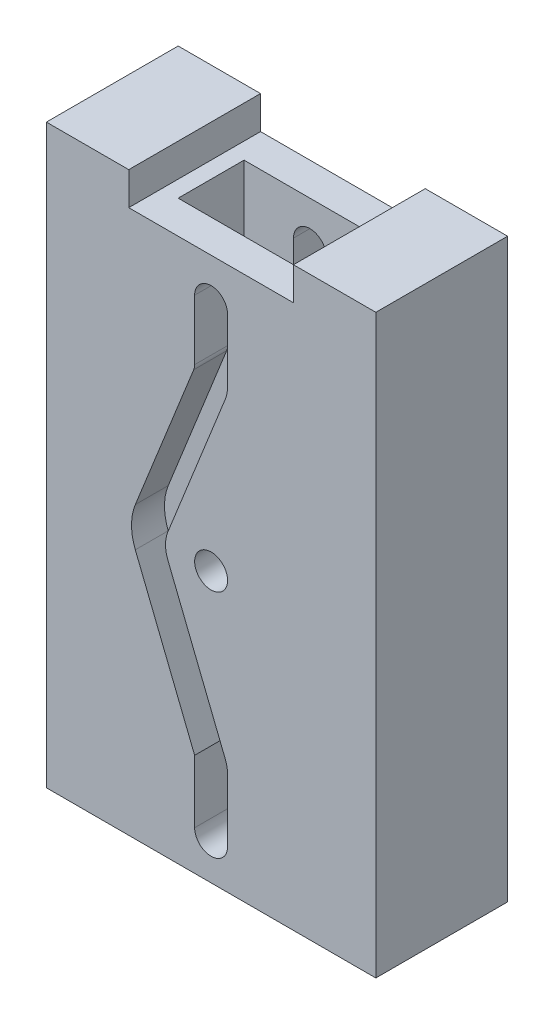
from build123d import *

# Parameters (mm, degrees)
BASE_EXTRUSION_DEPTH    = 40
ESQUISSE2_W             = 50
ESQUISSE2_H             = 40
ENL_V_MAT_EXTRU_1_DEPTH = 10
ESQUISSE10_W            = 20
ESQUISSE10_H            = 120
ENL_V_MAT_EXTRU_6_DEPTH = 70
ESQUISSE5_W             = 40
ESQUISSE5_H             = 20
ENL_V_MAT_EXTRU_3_DEPTH = 187.346451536
ENL_V_MAT_EXTRU_4_DEPTH = 187.346451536
ESQUISSE9_R             = 5
ENL_V_MAT_EXTRU_5_DEPTH = 187.346451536


with BuildPart() as part:
    # Esquisse1 → Base-Extrusion (new body)
    with BuildSketch(Plane.XY):
        Polygon((0, 0), (50, 0), (50, 175), (-50, 175), (-50, 0), align=None)
    extrude(amount=BASE_EXTRUSION_DEPTH)

    # Esquisse2 → Enl_v. mat.-Extru.1 (cut)
    with BuildSketch(Plane(origin=(0, 175, 0), x_dir=(-1, 0, 0), z_dir=(0, 1, 0))):
        with Locations((0, 20)):
            Rectangle(ESQUISSE2_W, ESQUISSE2_H)
    extrude(amount=-ENL_V_MAT_EXTRU_1_DEPTH, mode=Mode.SUBTRACT)

    # Esquisse10 → Enl_v. mat.-Extru.6 (cut)
    with BuildSketch(Plane.ZY.offset(50)):
        with Locations((20, 70)):
            Rectangle(ESQUISSE10_W, ESQUISSE10_H)
    extrude(amount=-ENL_V_MAT_EXTRU_6_DEPTH, mode=Mode.SUBTRACT)

    # Esquisse5 → Enl_v. mat.-Extru.3 (cut, through all)
    with BuildSketch(Plane(origin=(0, 175, 0), x_dir=(-1, 0, 0), z_dir=(0, 1, 0))):
        with Locations((0, 20)):
            Rectangle(ESQUISSE5_W, ESQUISSE5_H)
    extrude(amount=-ENL_V_MAT_EXTRU_3_DEPTH, mode=Mode.SUBTRACT)

    # Esquisse6 → Enl_v. mat.-Extru.4 (cut, through all)
    with BuildSketch(Plane.XY.offset(40)):
        with BuildLine():
            Line((-5, 152), (-5, 133.733241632))
            ThreePointArc((-5, 133.733241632), (-5.072174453, 132.976811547), (-5.286093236, 132.247678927))
            Line((-5.286093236, 132.247678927), (-23.008264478, 87.942250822))
            ThreePointArc((-23.008264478, 87.942250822), (-24.152637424, 82), (-23.008264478, 76.057749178))
            Line((-23.008264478, 76.057749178), (-5, 31.037087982))
            Line((-5, 31.037087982), (-5, 12))
            ThreePointArc((-5, 12), (0, 7), (5, 12))
            Line((5, 12), (5, 31.037087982))
            ThreePointArc((5, 31.037087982), (4.819563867, 32.928163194), (4.284766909, 34.750994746))
            Line((4.284766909, 34.750994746), (-13.129272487, 78.286093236))
            ThreePointArc((-13.129272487, 78.286093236), (-13.844505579, 82), (-13.129272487, 85.713906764))
            Line((-13.129272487, 85.713906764), (4.284766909, 129.249005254))
            ThreePointArc((4.284766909, 129.249005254), (4.819563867, 131.071836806), (5, 132.962912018))
            Line((5, 132.962912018), (5, 152))
            ThreePointArc((5, 152), (0, 157), (-5, 152))
        make_face()
    extrude(amount=-ENL_V_MAT_EXTRU_4_DEPTH, mode=Mode.SUBTRACT)

    # Esquisse9 → Enl_v. mat.-Extru.5 (cut, through all)
    with BuildSketch(Plane.XY.offset(40)):
        with Locations((0, 82)):
            Circle(ESQUISSE9_R)
    extrude(amount=-ENL_V_MAT_EXTRU_5_DEPTH, mode=Mode.SUBTRACT)


solid = part.part
